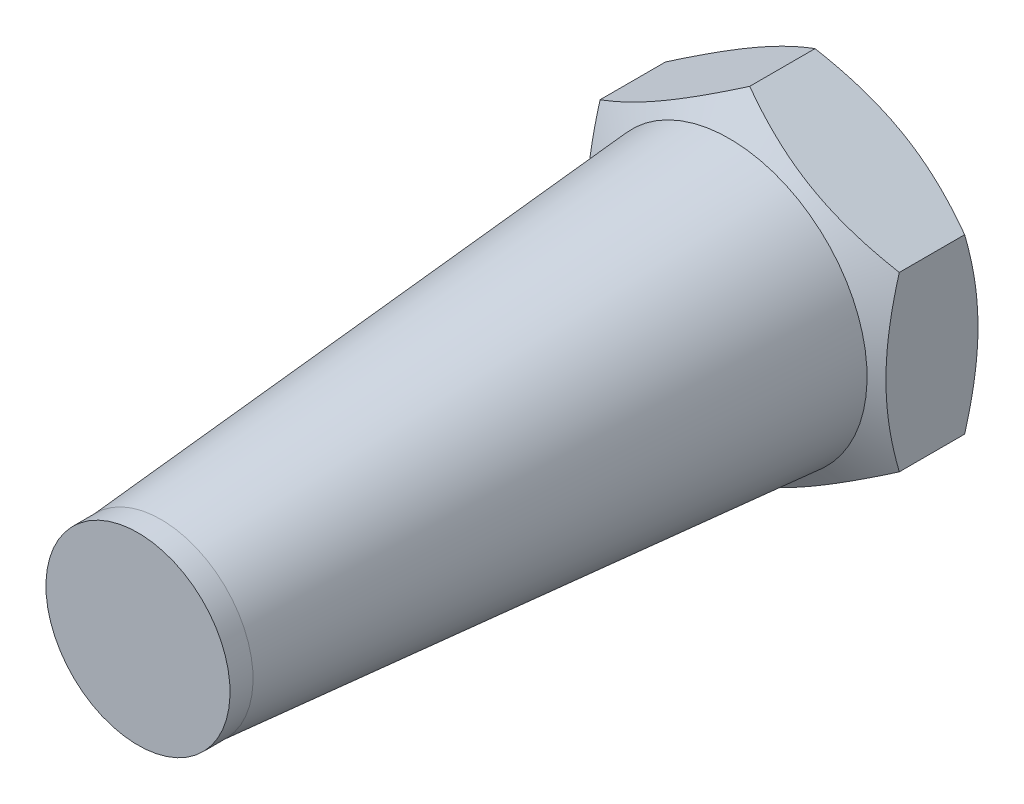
ISO-10303-21;
HEADER;
FILE_DESCRIPTION(('STEP AP214'),'2;1');
FILE_NAME('part.step','',(''),(''),'','','');
FILE_SCHEMA(('AUTOMOTIVE_DESIGN { 1 0 10303 214 1 1 1 1 }'));
ENDSEC;
DATA;
#1=APPLICATION_CONTEXT('core data for automotive mechanical design processes');
#2=APPLICATION_PROTOCOL_DEFINITION('international standard','automotive_design',2000,#1);
#3=PRODUCT_CONTEXT('',#1,'mechanical');
#4=PRODUCT('Part','Part','',(#3));
#5=PRODUCT_RELATED_PRODUCT_CATEGORY('part','',(#4));
#6=PRODUCT_DEFINITION_FORMATION('','',#4);
#7=PRODUCT_DEFINITION_CONTEXT('part definition',#1,'design');
#8=PRODUCT_DEFINITION('design','',#6,#7);
#9=PRODUCT_DEFINITION_SHAPE('','',#8);
#10=(LENGTH_UNIT() NAMED_UNIT(*) SI_UNIT(.MILLI.,.METRE.));
#11=(NAMED_UNIT(*) PLANE_ANGLE_UNIT() SI_UNIT($,.RADIAN.));
#12=(NAMED_UNIT(*) SI_UNIT($,.STERADIAN.) SOLID_ANGLE_UNIT());
#13=UNCERTAINTY_MEASURE_WITH_UNIT(LENGTH_MEASURE(1.E-05),#10,'distance_accuracy_value','');
#14=(GEOMETRIC_REPRESENTATION_CONTEXT(3) GLOBAL_UNCERTAINTY_ASSIGNED_CONTEXT((#13)) GLOBAL_UNIT_ASSIGNED_CONTEXT((#10,
#11,#12)) REPRESENTATION_CONTEXT('',''));
#15=CARTESIAN_POINT('',(0.,0.,0.));
#16=DIRECTION('',(0.,0.,1.));
#17=DIRECTION('',(1.,0.,0.));
#18=AXIS2_PLACEMENT_3D('',#15,#16,#17);
#19=CARTESIAN_POINT('',(0.,0.,2.));
#20=DIRECTION('',(0.,0.,-1.));
#21=DIRECTION('',(0.866025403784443,-0.499999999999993,0.));
#22=AXIS2_PLACEMENT_3D('',#19,#20,#21);
#23=CONICAL_SURFACE('',#22,9.9641016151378,1.0471975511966);
#24=CARTESIAN_POINT('',(0.,0.,4.3002221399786));
#25=DIRECTION('',(0.,0.,-1.));
#26=DIRECTION('',(0.866025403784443,-0.499999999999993,0.));
#27=AXIS2_PLACEMENT_3D('',#24,#25,#26);
#28=CIRCLE('',#27,5.98);
#29=CARTESIAN_POINT('',(5.17883191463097,-2.98999999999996,4.3002221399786));
#30=VERTEX_POINT('',#29);
#31=EDGE_CURVE('E274',#30,#30,#28,.T.);
#32=ORIENTED_EDGE('',*,*,#31,.T.);
#33=EDGE_LOOP('',(#32));
#34=FACE_BOUND('',#33,.T.);
#35=CARTESIAN_POINT('',(-5.50464676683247,10.6836627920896,0.813953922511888));
#36=CARTESIAN_POINT('',(-5.25856626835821,10.5415881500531,0.951906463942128));
#37=CARTESIAN_POINT('',(-5.01192350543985,10.3991888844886,1.08854446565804));
#38=CARTESIAN_POINT('',(-4.517214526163,10.1135685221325,1.35845260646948));
#39=CARTESIAN_POINT('',(-4.26914809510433,9.97034730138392,1.49172222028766));
#40=CARTESIAN_POINT('',(-3.77002670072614,9.68217942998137,1.75481910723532));
#41=CARTESIAN_POINT('',(-3.5189628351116,9.53722763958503,1.88462393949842));
#42=CARTESIAN_POINT('',(-3.01484675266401,9.2461760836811,2.13895929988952));
#43=CARTESIAN_POINT('',(-2.76179462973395,9.10007637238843,2.26349007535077));
#44=CARTESIAN_POINT('',(-2.24505569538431,8.80173700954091,2.50981565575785));
#45=CARTESIAN_POINT('',(-1.98129000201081,8.64945181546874,2.63139101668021));
#46=CARTESIAN_POINT('',(-1.45068168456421,8.34310496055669,2.86540938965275));
#47=CARTESIAN_POINT('',(-1.18383872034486,8.18904310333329,2.97785138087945));
#48=CARTESIAN_POINT('',(-0.647143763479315,7.87918212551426,3.19067263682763));
#49=CARTESIAN_POINT('',(-0.377299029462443,7.72338719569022,3.29107606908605));
#50=CARTESIAN_POINT('',(0.166264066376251,7.40956089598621,3.4766162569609));
#51=CARTESIAN_POINT('',(0.439981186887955,7.25153024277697,3.56175779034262));
#52=CARTESIAN_POINT('',(0.989916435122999,6.93402497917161,3.71225918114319));
#53=CARTESIAN_POINT('',(1.2661121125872,6.77456333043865,3.77772667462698));
#54=CARTESIAN_POINT('',(1.82200305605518,6.45361954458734,3.88518106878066));
#55=CARTESIAN_POINT('',(2.10169797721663,6.29213760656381,3.92717026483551));
#56=CARTESIAN_POINT('',(2.52089047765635,6.05011670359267,3.96975845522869));
#57=CARTESIAN_POINT('',(2.65964585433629,5.970006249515,3.98054959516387));
#58=CARTESIAN_POINT('',(2.9374336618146,5.8096253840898,3.99535095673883));
#59=CARTESIAN_POINT('',(3.07646608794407,5.72935497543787,3.99936129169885));
#60=CARTESIAN_POINT('',(3.35455197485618,5.56880201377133,4.00049782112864));
#61=CARTESIAN_POINT('',(3.4936054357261,5.48851946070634,3.99762398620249));
#62=CARTESIAN_POINT('',(3.77148360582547,5.32808642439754,3.98506477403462));
#63=CARTESIAN_POINT('',(3.91030830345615,5.24793594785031,3.97537906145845));
#64=CARTESIAN_POINT('',(4.24317824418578,5.05575339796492,3.94419318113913));
#65=CARTESIAN_POINT('',(4.43700457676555,4.94384771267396,3.91951007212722));
#66=CARTESIAN_POINT('',(4.8232260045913,4.72086266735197,3.85820420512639));
#67=CARTESIAN_POINT('',(5.01562090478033,4.60978341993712,3.8215798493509));
#68=CARTESIAN_POINT('',(5.59043287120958,4.27791557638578,3.69573612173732));
#69=CARTESIAN_POINT('',(5.97026630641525,4.05861864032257,3.59056847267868));
#70=CARTESIAN_POINT('',(6.53828857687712,3.73067082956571,3.40807580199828));
#71=CARTESIAN_POINT('',(6.72942027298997,3.62032089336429,3.34226066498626));
#72=CARTESIAN_POINT('',(7.10982731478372,3.40069278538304,3.20376518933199));
#73=CARTESIAN_POINT('',(7.29910264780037,3.29141462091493,3.13108480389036));
#74=CARTESIAN_POINT('',(7.67585644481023,3.07389571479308,2.98002751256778));
#75=CARTESIAN_POINT('',(7.86333546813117,2.96565465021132,2.90165244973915));
#76=CARTESIAN_POINT('',(8.23673796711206,2.75007061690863,2.74013098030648));
#77=CARTESIAN_POINT('',(8.42266146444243,2.64272763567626,2.65698464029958));
#78=CARTESIAN_POINT('',(8.87505986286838,2.38153529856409,2.44905554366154));
#79=CARTESIAN_POINT('',(9.14079224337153,2.2281146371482,2.32212222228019));
#80=CARTESIAN_POINT('',(9.6698907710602,1.92263945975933,2.0618223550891));
#81=CARTESIAN_POINT('',(9.93325674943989,1.77058504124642,1.9284553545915));
#82=CARTESIAN_POINT('',(10.4580868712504,1.4675742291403,1.65663156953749));
#83=CARTESIAN_POINT('',(10.7195505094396,1.31661812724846,1.51817348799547));
#84=CARTESIAN_POINT('',(11.2408413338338,1.01565072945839,1.237238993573));
#85=CARTESIAN_POINT('',(11.5006685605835,0.865639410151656,1.09476268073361));
#86=CARTESIAN_POINT('',(12.019282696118,0.566217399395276,0.806400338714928));
#87=CARTESIAN_POINT('',(12.278067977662,0.41680764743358,0.660510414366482));
#88=CARTESIAN_POINT('',(12.7945079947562,0.118640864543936,0.366083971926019));
#89=CARTESIAN_POINT('',(13.0521627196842,-0.0301161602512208,0.217547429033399));
#90=CARTESIAN_POINT('',(13.82363380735,-0.475525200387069,-0.231257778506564));
#91=CARTESIAN_POINT('',(14.3360362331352,-0.771360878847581,-0.534766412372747));
#92=CARTESIAN_POINT('',(15.3127558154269,-1.33527019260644,-1.12056744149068));
#93=CARTESIAN_POINT('',(15.7773029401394,-1.60347660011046,-1.40235093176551));
#94=CARTESIAN_POINT('',(16.7047068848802,-2.13891351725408,-1.9696523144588));
#95=CARTESIAN_POINT('',(17.1675636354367,-2.40614398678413,-2.25517035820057));
#96=CARTESIAN_POINT('',(18.0907213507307,-2.9391293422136,-2.82825869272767));
#97=CARTESIAN_POINT('',(18.5510258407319,-3.20488626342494,-3.11582142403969));
#98=CARTESIAN_POINT('',(19.470562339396,-3.73578090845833,-3.69314970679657));
#99=CARTESIAN_POINT('',(19.9297944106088,-4.00091866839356,-3.98291512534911));
#100=CARTESIAN_POINT('',(20.3886360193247,-4.26583099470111,-4.27349716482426));
#101=B_SPLINE_CURVE_WITH_KNOTS('',3,(#35,#36,#37,#38,#39,#40,#41,#42,#43,#44,#45,#46,#47,#48,
#49,#50,#51,#52,#53,#54,#55,#56,#57,#58,#59,#60,#61,#62,#63,#64,#65,#66,#67,#68,#69,#70,#71,#72,
#73,#74,#75,#76,#77,#78,#79,#80,#81,#82,#83,#84,#85,#86,#87,#88,#89,#90,#91,#92,#93,#94,#95,#96,
#97,#98,#99,#100),.UNSPECIFIED.,.F.,.F.,(4,2,2,2,2,2,2,2,2,2,2,2,2,2,2,2,2,2,2,2,2,2,2,2,2,2,2,
2,2,2,2,2,4),(0.,0.947611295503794,1.89536946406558,2.8482389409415,3.8010636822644,
4.78476621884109,5.76857855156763,6.75038157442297,7.73187670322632,8.70790002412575,
9.68382790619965,10.165457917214,10.6470798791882,11.128703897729,11.6103516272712,
12.285475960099,12.9606906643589,14.3118504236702,15.0027050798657,15.6935644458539,
16.3842012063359,17.074828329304,18.0709060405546,19.0670542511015,20.0634580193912,
21.0598370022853,22.0574144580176,23.0550012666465,25.0498701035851,26.8676185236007,
28.6854408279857,30.4983869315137,32.3112245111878),.UNSPECIFIED.);
#102=CARTESIAN_POINT('',(6.5,3.7527767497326,3.41944341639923));
#103=VERTEX_POINT('',#102);
#104=CARTESIAN_POINT('',(0.,7.50555349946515,3.41944341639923));
#105=VERTEX_POINT('',#104);
#106=EDGE_CURVE('E102',#103,#105,#101,.F.);
#107=ORIENTED_EDGE('',*,*,#106,.T.);
#108=CARTESIAN_POINT('',(0.00019999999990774,7.50566896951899,3.41937674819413));
#109=CARTESIAN_POINT('',(-0.142677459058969,7.42317863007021,3.46699557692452));
#110=CARTESIAN_POINT('',(-0.286087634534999,7.34038072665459,3.5124532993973));
#111=CARTESIAN_POINT('',(-0.574072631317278,7.17411251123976,3.59845131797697));
#112=CARTESIAN_POINT('',(-0.718647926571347,7.09064192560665,3.63898949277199));
#113=CARTESIAN_POINT('',(-1.15468865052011,6.83889369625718,3.7524289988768));
#114=CARTESIAN_POINT('',(-1.4478752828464,6.6696223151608,3.81695219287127));
#115=CARTESIAN_POINT('',(-1.88662374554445,6.41631077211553,3.89261341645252));
#116=CARTESIAN_POINT('',(-2.03087463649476,6.33302748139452,3.91416714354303));
#117=CARTESIAN_POINT('',(-2.32002821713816,6.16608458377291,3.9503096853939));
#118=CARTESIAN_POINT('',(-2.46493084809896,6.0824250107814,3.96489911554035));
#119=CARTESIAN_POINT('',(-2.75498777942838,5.91496056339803,3.98674124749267));
#120=CARTESIAN_POINT('',(-2.90014160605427,5.83115596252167,3.99400227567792));
#121=CARTESIAN_POINT('',(-3.19057533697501,5.66347396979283,4.00103969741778));
#122=CARTESIAN_POINT('',(-3.33585523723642,5.57959658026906,4.0008163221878));
#123=CARTESIAN_POINT('',(-3.73387594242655,5.34979921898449,3.98991654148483));
#124=CARTESIAN_POINT('',(-3.98648646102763,5.20395446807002,3.9716181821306));
#125=CARTESIAN_POINT('',(-4.49002967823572,4.9132336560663,3.91359365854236));
#126=CARTESIAN_POINT('',(-4.74096060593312,4.7683586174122,3.87384766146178));
#127=CARTESIAN_POINT('',(-5.24551722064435,4.47705272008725,3.77449409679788));
#128=CARTESIAN_POINT('',(-5.49907924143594,4.33065861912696,3.71446557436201));
#129=CARTESIAN_POINT('',(-6.00242193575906,4.04005357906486,3.57822500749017));
#130=CARTESIAN_POINT('',(-6.25220905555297,3.89583891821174,3.50204496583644));
#131=CARTESIAN_POINT('',(-6.5002,3.75266127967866,3.41937674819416));
#132=B_SPLINE_CURVE_WITH_KNOTS('',3,(#108,#109,#110,#111,#112,#113,#114,#115,#116,#117,#118,
#119,#120,#121,#122,#123,#124,#125,#126,#127,#128,#129,#130,#131),.UNSPECIFIED.,.F.,.F.,(4,2,2,
2,2,2,2,2,2,2,2,4),(0.,0.51510505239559,1.03043143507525,2.06322554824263,2.56697389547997,
3.07067772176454,3.57380860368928,4.07692394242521,4.9527935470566,5.82947446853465,
6.72559912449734,7.61996451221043),.UNSPECIFIED.);
#133=CARTESIAN_POINT('',(-6.5,3.7527767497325,3.41944341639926));
#134=VERTEX_POINT('',#133);
#135=EDGE_CURVE('E93',#105,#134,#132,.T.);
#136=ORIENTED_EDGE('',*,*,#135,.T.);
#137=CARTESIAN_POINT('',(-6.5,3.75300768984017,3.41937674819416));
#138=CARTESIAN_POINT('',(-6.5,3.58802701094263,3.46699557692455));
#139=CARTESIAN_POINT('',(-6.5,3.42243120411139,3.51245329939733));
#140=CARTESIAN_POINT('',(-6.5,3.08989477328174,3.59845131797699));
#141=CARTESIAN_POINT('',(-6.5,2.92295360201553,3.63898949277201));
#142=CARTESIAN_POINT('',(-6.5,2.41945714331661,3.75242899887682));
#143=CARTESIAN_POINT('',(-6.5,2.08091438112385,3.81695219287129));
#144=CARTESIAN_POINT('',(-6.5,1.57429129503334,3.89261341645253));
#145=CARTESIAN_POINT('',(-6.5,1.40772471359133,3.91416714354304));
#146=CARTESIAN_POINT('',(-6.5,1.07383891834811,3.9503096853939));
#147=CARTESIAN_POINT('',(-6.5,0.9065197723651,3.96489911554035));
#148=CARTESIAN_POINT('',(-6.5,0.571590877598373,3.98674124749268));
#149=CARTESIAN_POINT('',(-6.5,0.403981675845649,3.99400227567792));
#150=CARTESIAN_POINT('',(-6.5,0.0686176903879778,4.00103969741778));
#151=CARTESIAN_POINT('',(-6.5,-0.0991370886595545,4.0008163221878));
#152=CARTESIAN_POINT('',(-6.5,-0.558731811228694,3.98991654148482));
#153=CARTESIAN_POINT('',(-6.5,-0.850421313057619,3.97161818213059));
#154=CARTESIAN_POINT('',(-6.5,-1.43186293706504,3.91359365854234));
#155=CARTESIAN_POINT('',(-6.5,-1.72161301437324,3.87384766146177));
#156=CARTESIAN_POINT('',(-6.5,-2.30422480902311,3.77449409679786));
#157=CARTESIAN_POINT('',(-6.5,-2.59701301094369,3.71446557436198));
#158=CARTESIAN_POINT('',(-6.5,-3.17822309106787,3.57822500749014));
#159=CARTESIAN_POINT('',(-6.5,-3.46665241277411,3.50204496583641));
#160=CARTESIAN_POINT('',(-6.5,-3.75300768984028,3.41937674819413));
#161=B_SPLINE_CURVE_WITH_KNOTS('',3,(#137,#138,#139,#140,#141,#142,#143,#144,#145,#146,#147,
#148,#149,#150,#151,#152,#153,#154,#155,#156,#157,#158,#159,#160),.UNSPECIFIED.,.F.,.F.,(4,2,2,
2,2,2,2,2,2,2,2,4),(0.,0.515105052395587,1.03043143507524,2.06322554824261,2.56697389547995,
3.07067772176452,3.57380860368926,4.07692394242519,4.95279354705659,5.82947446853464,
6.72559912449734,7.61996451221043),.UNSPECIFIED.);
#162=CARTESIAN_POINT('',(-6.5,-3.7527767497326,3.41944341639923));
#163=VERTEX_POINT('',#162);
#164=EDGE_CURVE('E82',#134,#163,#161,.T.);
#165=ORIENTED_EDGE('',*,*,#164,.T.);
#166=CARTESIAN_POINT('',(-12.0046467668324,-0.57466745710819,0.813953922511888));
#167=CARTESIAN_POINT('',(-11.7585662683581,-0.71674209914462,0.951906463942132));
#168=CARTESIAN_POINT('',(-11.5119235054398,-0.859141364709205,1.08854446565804));
#169=CARTESIAN_POINT('',(-11.0172145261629,-1.14476172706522,1.35845260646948));
#170=CARTESIAN_POINT('',(-10.7691480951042,-1.28798294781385,1.49172222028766));
#171=CARTESIAN_POINT('',(-10.270026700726,-1.57615081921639,1.75481910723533));
#172=CARTESIAN_POINT('',(-10.0189628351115,-1.72110260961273,1.88462393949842));
#173=CARTESIAN_POINT('',(-9.51484675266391,-2.01215416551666,2.13895929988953));
#174=CARTESIAN_POINT('',(-9.26179462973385,-2.15825387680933,2.26349007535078));
#175=CARTESIAN_POINT('',(-8.74505569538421,-2.45659323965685,2.50981565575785));
#176=CARTESIAN_POINT('',(-8.48129000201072,-2.60887843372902,2.63139101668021));
#177=CARTESIAN_POINT('',(-7.95068168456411,-2.91522528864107,2.86540938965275));
#178=CARTESIAN_POINT('',(-7.68383872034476,-3.06928714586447,2.97785138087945));
#179=CARTESIAN_POINT('',(-7.14714376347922,-3.3791481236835,3.19067263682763));
#180=CARTESIAN_POINT('',(-6.87729902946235,-3.53494305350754,3.29107606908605));
#181=CARTESIAN_POINT('',(-6.33373593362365,-3.84876935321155,3.4766162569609));
#182=CARTESIAN_POINT('',(-6.06001881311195,-4.00680000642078,3.56175779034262));
#183=CARTESIAN_POINT('',(-5.5100835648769,-4.32430527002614,3.71225918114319));
#184=CARTESIAN_POINT('',(-5.23388788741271,-4.48376691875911,3.77772667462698));
#185=CARTESIAN_POINT('',(-4.67799694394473,-4.80471070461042,3.88518106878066));
#186=CARTESIAN_POINT('',(-4.39830202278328,-4.96619264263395,3.92717026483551));
#187=CARTESIAN_POINT('',(-3.97910952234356,-5.20821354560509,3.96975845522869));
#188=CARTESIAN_POINT('',(-3.84035414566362,-5.28832399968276,3.98054959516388));
#189=CARTESIAN_POINT('',(-3.56256633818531,-5.44870486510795,3.99535095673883));
#190=CARTESIAN_POINT('',(-3.42353391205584,-5.52897527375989,3.99936129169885));
#191=CARTESIAN_POINT('',(-3.14544802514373,-5.68952823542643,4.00049782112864));
#192=CARTESIAN_POINT('',(-3.00639456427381,-5.76981078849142,3.99762398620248));
#193=CARTESIAN_POINT('',(-2.72851639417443,-5.93024382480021,3.98506477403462));
#194=CARTESIAN_POINT('',(-2.58969169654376,-6.01039430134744,3.97537906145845));
#195=CARTESIAN_POINT('',(-2.25682175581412,-6.20257685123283,3.94419318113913));
#196=CARTESIAN_POINT('',(-2.06299542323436,-6.3144825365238,3.91951007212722));
#197=CARTESIAN_POINT('',(-1.67677399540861,-6.53746758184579,3.85820420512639));
#198=CARTESIAN_POINT('',(-1.48437909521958,-6.64854682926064,3.8215798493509));
#199=CARTESIAN_POINT('',(-0.909567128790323,-6.98041467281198,3.69573612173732));
#200=CARTESIAN_POINT('',(-0.529733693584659,-7.19971160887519,3.59056847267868));
#201=CARTESIAN_POINT('',(0.0382885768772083,-7.52765941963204,3.40807580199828));
#202=CARTESIAN_POINT('',(0.229420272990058,-7.63800935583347,3.34226066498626));
#203=CARTESIAN_POINT('',(0.609827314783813,-7.85763746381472,3.20376518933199));
#204=CARTESIAN_POINT('',(0.799102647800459,-7.96691562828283,3.13108480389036));
#205=CARTESIAN_POINT('',(1.17585644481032,-8.18443453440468,2.98002751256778));
#206=CARTESIAN_POINT('',(1.36333546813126,-8.29267559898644,2.90165244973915));
#207=CARTESIAN_POINT('',(1.73673796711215,-8.50825963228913,2.74013098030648));
#208=CARTESIAN_POINT('',(1.92266146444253,-8.61560261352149,2.65698464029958));
#209=CARTESIAN_POINT('',(2.37505986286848,-8.87679495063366,2.44905554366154));
#210=CARTESIAN_POINT('',(2.64079224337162,-9.03021561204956,2.32212222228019));
#211=CARTESIAN_POINT('',(3.16989077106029,-9.33569078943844,2.0618223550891));
#212=CARTESIAN_POINT('',(3.43325674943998,-9.48774520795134,1.9284553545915));
#213=CARTESIAN_POINT('',(3.9580868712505,-9.79075602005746,1.65663156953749));
#214=CARTESIAN_POINT('',(4.21955050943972,-9.9417121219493,1.51817348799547));
#215=CARTESIAN_POINT('',(4.74084133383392,-10.2426795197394,1.237238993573));
#216=CARTESIAN_POINT('',(5.00066856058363,-10.3926908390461,1.09476268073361));
#217=CARTESIAN_POINT('',(5.51928269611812,-10.6921128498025,0.806400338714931));
#218=CARTESIAN_POINT('',(5.77806797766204,-10.8415226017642,0.660510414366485));
#219=CARTESIAN_POINT('',(6.29450799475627,-11.1396893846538,0.366083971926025));
#220=CARTESIAN_POINT('',(6.55216271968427,-11.288446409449,0.217547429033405));
#221=CARTESIAN_POINT('',(7.32363380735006,-11.7338554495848,-0.231257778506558));
#222=CARTESIAN_POINT('',(7.83603623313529,-12.0296911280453,-0.534766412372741));
#223=CARTESIAN_POINT('',(8.81275581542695,-12.5936004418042,-1.12056744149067));
#224=CARTESIAN_POINT('',(9.27730294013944,-12.8618068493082,-1.40235093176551));
#225=CARTESIAN_POINT('',(10.2047068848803,-13.3972437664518,-1.96965231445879));
#226=CARTESIAN_POINT('',(10.6675636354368,-13.6644742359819,-2.25517035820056));
#227=CARTESIAN_POINT('',(11.5907213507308,-14.1974595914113,-2.82825869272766));
#228=CARTESIAN_POINT('',(12.0510258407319,-14.4632165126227,-3.11582142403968));
#229=CARTESIAN_POINT('',(12.970562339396,-14.9941111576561,-3.69314970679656));
#230=CARTESIAN_POINT('',(13.4297944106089,-15.2592489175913,-3.9829151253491));
#231=CARTESIAN_POINT('',(13.8886360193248,-15.5241612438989,-4.27349716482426));
#232=B_SPLINE_CURVE_WITH_KNOTS('',3,(#166,#167,#168,#169,#170,#171,#172,#173,#174,#175,#176,
#177,#178,#179,#180,#181,#182,#183,#184,#185,#186,#187,#188,#189,#190,#191,#192,#193,#194,#195,
#196,#197,#198,#199,#200,#201,#202,#203,#204,#205,#206,#207,#208,#209,#210,#211,#212,#213,#214,
#215,#216,#217,#218,#219,#220,#221,#222,#223,#224,#225,#226,#227,#228,#229,#230,#231),
.UNSPECIFIED.,.F.,.F.,(4,2,2,2,2,2,2,2,2,2,2,2,2,2,2,2,2,2,2,2,2,2,2,2,2,2,2,2,2,2,2,2,4),(0.,
0.947611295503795,1.89536946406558,2.8482389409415,3.80106368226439,4.78476621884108,
5.76857855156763,6.75038157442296,7.73187670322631,8.70790002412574,9.68382790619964,
10.165457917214,10.6470798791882,11.128703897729,11.6103516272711,12.285475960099,
12.9606906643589,14.3118504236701,15.0027050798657,15.6935644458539,16.3842012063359,
17.074828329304,18.0709060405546,19.0670542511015,20.0634580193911,21.0598370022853,
22.0574144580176,23.0550012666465,25.0498701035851,26.8676185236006,28.6854408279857,
30.4983869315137,32.3112245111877),.UNSPECIFIED.);
#233=CARTESIAN_POINT('',(0.,-7.50555349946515,3.41944341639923));
#234=VERTEX_POINT('',#233);
#235=EDGE_CURVE('E228',#163,#234,#232,.T.);
#236=ORIENTED_EDGE('',*,*,#235,.T.);
#237=CARTESIAN_POINT('',(-0.00019999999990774,-7.50566896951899,3.41937674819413));
#238=CARTESIAN_POINT('',(0.142677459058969,-7.42317863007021,3.46699557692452));
#239=CARTESIAN_POINT('',(0.286087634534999,-7.34038072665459,3.5124532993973));
#240=CARTESIAN_POINT('',(0.574072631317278,-7.17411251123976,3.59845131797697));
#241=CARTESIAN_POINT('',(0.718647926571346,-7.09064192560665,3.63898949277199));
#242=CARTESIAN_POINT('',(1.15468865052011,-6.83889369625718,3.7524289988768));
#243=CARTESIAN_POINT('',(1.4478752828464,-6.6696223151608,3.81695219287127));
#244=CARTESIAN_POINT('',(1.88662374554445,-6.41631077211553,3.89261341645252));
#245=CARTESIAN_POINT('',(2.03087463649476,-6.33302748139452,3.91416714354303));
#246=CARTESIAN_POINT('',(2.32002821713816,-6.16608458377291,3.9503096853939));
#247=CARTESIAN_POINT('',(2.46493084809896,-6.0824250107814,3.96489911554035));
#248=CARTESIAN_POINT('',(2.75498777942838,-5.91496056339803,3.98674124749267));
#249=CARTESIAN_POINT('',(2.90014160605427,-5.83115596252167,3.99400227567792));
#250=CARTESIAN_POINT('',(3.19057533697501,-5.66347396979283,4.00103969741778));
#251=CARTESIAN_POINT('',(3.33585523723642,-5.57959658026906,4.0008163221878));
#252=CARTESIAN_POINT('',(3.73387594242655,-5.34979921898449,3.98991654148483));
#253=CARTESIAN_POINT('',(3.98648646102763,-5.20395446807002,3.9716181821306));
#254=CARTESIAN_POINT('',(4.49002967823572,-4.9132336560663,3.91359365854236));
#255=CARTESIAN_POINT('',(4.74096060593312,-4.7683586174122,3.87384766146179));
#256=CARTESIAN_POINT('',(5.24551722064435,-4.47705272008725,3.77449409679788));
#257=CARTESIAN_POINT('',(5.49907924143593,-4.33065861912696,3.71446557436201));
#258=CARTESIAN_POINT('',(6.00242193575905,-4.04005357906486,3.57822500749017));
#259=CARTESIAN_POINT('',(6.25220905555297,-3.89583891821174,3.50204496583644));
#260=CARTESIAN_POINT('',(6.5002,-3.75266127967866,3.41937674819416));
#261=B_SPLINE_CURVE_WITH_KNOTS('',3,(#237,#238,#239,#240,#241,#242,#243,#244,#245,#246,#247,
#248,#249,#250,#251,#252,#253,#254,#255,#256,#257,#258,#259,#260),.UNSPECIFIED.,.F.,.F.,(4,2,2,
2,2,2,2,2,2,2,2,4),(0.,0.515105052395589,1.03043143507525,2.06322554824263,2.56697389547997,
3.07067772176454,3.57380860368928,4.07692394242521,4.9527935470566,5.82947446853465,
6.72559912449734,7.61996451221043),.UNSPECIFIED.);
#262=CARTESIAN_POINT('',(6.5,-3.7527767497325,3.41944341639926));
#263=VERTEX_POINT('',#262);
#264=EDGE_CURVE('E215',#234,#263,#261,.T.);
#265=ORIENTED_EDGE('',*,*,#264,.T.);
#266=CARTESIAN_POINT('',(6.5,-3.75300768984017,3.41937674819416));
#267=CARTESIAN_POINT('',(6.5,-3.58802701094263,3.46699557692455));
#268=CARTESIAN_POINT('',(6.5,-3.42243120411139,3.51245329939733));
#269=CARTESIAN_POINT('',(6.5,-3.08989477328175,3.59845131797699));
#270=CARTESIAN_POINT('',(6.5,-2.92295360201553,3.63898949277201));
#271=CARTESIAN_POINT('',(6.5,-2.41945714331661,3.75242899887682));
#272=CARTESIAN_POINT('',(6.5,-2.08091438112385,3.81695219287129));
#273=CARTESIAN_POINT('',(6.5,-1.57429129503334,3.89261341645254));
#274=CARTESIAN_POINT('',(6.5,-1.40772471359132,3.91416714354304));
#275=CARTESIAN_POINT('',(6.5,-1.0738389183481,3.95030968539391));
#276=CARTESIAN_POINT('',(6.5,-0.906519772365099,3.96489911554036));
#277=CARTESIAN_POINT('',(6.5,-0.571590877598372,3.98674124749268));
#278=CARTESIAN_POINT('',(6.5,-0.403981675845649,3.99400227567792));
#279=CARTESIAN_POINT('',(6.5,-0.0686176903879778,4.00103969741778));
#280=CARTESIAN_POINT('',(6.5,0.0991370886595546,4.0008163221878));
#281=CARTESIAN_POINT('',(6.5,0.558731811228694,3.98991654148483));
#282=CARTESIAN_POINT('',(6.5,0.850421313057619,3.97161818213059));
#283=CARTESIAN_POINT('',(6.5,1.43186293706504,3.91359365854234));
#284=CARTESIAN_POINT('',(6.5,1.72161301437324,3.87384766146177));
#285=CARTESIAN_POINT('',(6.5,2.30422480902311,3.77449409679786));
#286=CARTESIAN_POINT('',(6.5,2.59701301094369,3.71446557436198));
#287=CARTESIAN_POINT('',(6.5,3.17822309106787,3.57822500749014));
#288=CARTESIAN_POINT('',(6.5,3.46665241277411,3.50204496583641));
#289=CARTESIAN_POINT('',(6.5,3.75300768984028,3.41937674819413));
#290=B_SPLINE_CURVE_WITH_KNOTS('',3,(#266,#267,#268,#269,#270,#271,#272,#273,#274,#275,#276,
#277,#278,#279,#280,#281,#282,#283,#284,#285,#286,#287,#288,#289),.UNSPECIFIED.,.F.,.F.,(4,2,2,
2,2,2,2,2,2,2,2,4),(0.,0.515105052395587,1.03043143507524,2.06322554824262,2.56697389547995,
3.07067772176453,3.57380860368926,4.07692394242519,4.95279354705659,5.82947446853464,
6.72559912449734,7.61996451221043),.UNSPECIFIED.);
#291=EDGE_CURVE('E188',#263,#103,#290,.T.);
#292=ORIENTED_EDGE('',*,*,#291,.T.);
#293=EDGE_LOOP('',(#107,#136,#165,#236,#265,#292));
#294=FACE_BOUND('',#293,.T.);
#295=ADVANCED_FACE('F14',(#34,#294),#23,.T.);
#296=CARTESIAN_POINT('',(0.,0.,30.));
#297=DIRECTION('',(0.,0.,1.));
#298=DIRECTION('',(-0.866025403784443,0.499999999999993,0.));
#299=AXIS2_PLACEMENT_3D('',#296,#297,#298);
#300=PLANE('',#299);
#301=CARTESIAN_POINT('',(0.,0.,30.));
#302=DIRECTION('',(0.,0.,-1.));
#303=DIRECTION('',(0.866025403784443,-0.499999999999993,0.));
#304=AXIS2_PLACEMENT_3D('',#301,#302,#303);
#305=CIRCLE('',#304,4.);
#306=CARTESIAN_POINT('',(3.46410161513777,-1.99999999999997,30.));
#307=VERTEX_POINT('',#306);
#308=EDGE_CURVE('E9',#307,#307,#305,.T.);
#309=ORIENTED_EDGE('',*,*,#308,.F.);
#310=EDGE_LOOP('',(#309));
#311=FACE_BOUND('',#310,.T.);
#312=ADVANCED_FACE('F16',(#311),#300,.T.);
#313=CARTESIAN_POINT('',(0.,0.,15.4735));
#314=DIRECTION('',(0.,0.,-1.));
#315=DIRECTION('',(0.866025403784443,-0.499999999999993,0.));
#316=AXIS2_PLACEMENT_3D('',#313,#314,#315);
#317=CYLINDRICAL_SURFACE('',#316,4.);
#318=ORIENTED_EDGE('',*,*,#308,.T.);
#319=EDGE_LOOP('',(#318));
#320=FACE_BOUND('',#319,.T.);
#321=CARTESIAN_POINT('',(0.,0.,29.));
#322=DIRECTION('',(0.,0.,-1.));
#323=DIRECTION('',(0.866025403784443,-0.499999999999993,0.));
#324=AXIS2_PLACEMENT_3D('',#321,#322,#323);
#325=CIRCLE('',#324,4.);
#326=CARTESIAN_POINT('',(3.46410161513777,-1.99999999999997,29.));
#327=VERTEX_POINT('',#326);
#328=EDGE_CURVE('E22',#327,#327,#325,.T.);
#329=ORIENTED_EDGE('',*,*,#328,.F.);
#330=EDGE_LOOP('',(#329));
#331=FACE_BOUND('',#330,.T.);
#332=ADVANCED_FACE('F301',(#320,#331),#317,.T.);
#333=CARTESIAN_POINT('',(0.,0.,4.3002221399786));
#334=DIRECTION('',(0.,0.,-1.));
#335=DIRECTION('',(0.866025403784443,-0.499999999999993,0.));
#336=AXIS2_PLACEMENT_3D('',#333,#334,#335);
#337=CONICAL_SURFACE('',#336,5.98,0.0799916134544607);
#338=ORIENTED_EDGE('',*,*,#328,.T.);
#339=EDGE_LOOP('',(#338));
#340=FACE_BOUND('',#339,.T.);
#341=ORIENTED_EDGE('',*,*,#31,.F.);
#342=EDGE_LOOP('',(#341));
#343=FACE_BOUND('',#342,.T.);
#344=ADVANCED_FACE('F131',(#340,#343),#337,.T.);
#345=CARTESIAN_POINT('',(0.,7.50555349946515,-30.));
#346=DIRECTION('',(-0.500000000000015,0.866025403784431,0.));
#347=DIRECTION('',(-0.866025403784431,-0.500000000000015,0.));
#348=AXIS2_PLACEMENT_3D('',#345,#346,#347);
#349=PLANE('',#348);
#350=DIRECTION('',(0.,0.,1.));
#351=VECTOR('',#350,1.);
#352=CARTESIAN_POINT('',(0.,7.50555349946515,-30.));
#353=LINE('',#352,#351);
#354=CARTESIAN_POINT('',(0.,7.50555349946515,0.580556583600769));
#355=VERTEX_POINT('',#354);
#356=EDGE_CURVE('E258',#355,#105,#353,.T.);
#357=ORIENTED_EDGE('',*,*,#356,.F.);
#358=CARTESIAN_POINT('',(-6.5002,3.75266127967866,0.580623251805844));
#359=CARTESIAN_POINT('',(-6.35732254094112,3.83515161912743,0.533004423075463));
#360=CARTESIAN_POINT('',(-6.21391236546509,3.91794952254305,0.487546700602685));
#361=CARTESIAN_POINT('',(-5.92592736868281,4.08421773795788,0.401548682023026));
#362=CARTESIAN_POINT('',(-5.78135207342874,4.16768832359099,0.361010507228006));
#363=CARTESIAN_POINT('',(-5.34531134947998,4.41943655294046,0.247571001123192));
#364=CARTESIAN_POINT('',(-5.05212471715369,4.58870793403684,0.183047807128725));
#365=CARTESIAN_POINT('',(-4.61337625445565,4.8420194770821,0.107386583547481));
#366=CARTESIAN_POINT('',(-4.46912536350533,4.92530276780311,0.0858328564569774));
#367=CARTESIAN_POINT('',(-4.17997178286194,5.09224566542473,0.0496903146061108));
#368=CARTESIAN_POINT('',(-4.03506915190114,5.17590523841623,0.0351008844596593));
#369=CARTESIAN_POINT('',(-3.74501222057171,5.3433696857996,0.0132587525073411));
#370=CARTESIAN_POINT('',(-3.59985839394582,5.42717428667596,0.00599772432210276));
#371=CARTESIAN_POINT('',(-3.30942466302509,5.59485627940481,-0.00103969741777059));
#372=CARTESIAN_POINT('',(-3.16414476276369,5.67873366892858,-0.000816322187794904));
#373=CARTESIAN_POINT('',(-2.76612405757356,5.90853103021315,0.0100834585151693));
#374=CARTESIAN_POINT('',(-2.51351353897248,6.05437578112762,0.0283818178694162));
#375=CARTESIAN_POINT('',(-2.00997032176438,6.34509659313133,0.0864063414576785));
#376=CARTESIAN_POINT('',(-1.75903939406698,6.48997163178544,0.12615233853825));
#377=CARTESIAN_POINT('',(-1.25448277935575,6.78127752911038,0.225505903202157));
#378=CARTESIAN_POINT('',(-1.00092075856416,6.92767163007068,0.285534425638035));
#379=CARTESIAN_POINT('',(-0.497578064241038,7.21827667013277,0.421774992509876));
#380=CARTESIAN_POINT('',(-0.247790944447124,7.3624913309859,0.4979550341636));
#381=CARTESIAN_POINT('',(0.00019999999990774,7.50566896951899,0.580623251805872));
#382=B_SPLINE_CURVE_WITH_KNOTS('',3,(#358,#359,#360,#361,#362,#363,#364,#365,#366,#367,#368,
#369,#370,#371,#372,#373,#374,#375,#376,#377,#378,#379,#380,#381),.UNSPECIFIED.,.F.,.F.,(4,2,2,
2,2,2,2,2,2,2,2,4),(0.,0.515105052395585,1.03043143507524,2.06322554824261,2.56697389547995,
3.07067772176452,3.57380860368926,4.07692394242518,4.95279354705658,5.82947446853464,
6.72559912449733,7.61996451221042),.UNSPECIFIED.);
#383=CARTESIAN_POINT('',(-3.25000000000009,5.6291651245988,0.));
#384=VERTEX_POINT('',#383);
#385=EDGE_CURVE('E109',#384,#355,#382,.T.);
#386=ORIENTED_EDGE('',*,*,#385,.F.);
#387=CARTESIAN_POINT('',(-6.5,3.7527767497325,0.580556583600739));
#388=VERTEX_POINT('',#387);
#389=EDGE_CURVE('E96',#388,#384,#382,.T.);
#390=ORIENTED_EDGE('',*,*,#389,.F.);
#391=DIRECTION('',(0.,0.,1.));
#392=VECTOR('',#391,1.);
#393=CARTESIAN_POINT('',(-6.5,3.7527767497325,-30.));
#394=LINE('',#393,#392);
#395=EDGE_CURVE('E35',#388,#134,#394,.T.);
#396=ORIENTED_EDGE('',*,*,#395,.T.);
#397=ORIENTED_EDGE('',*,*,#135,.F.);
#398=EDGE_LOOP('',(#357,#386,#390,#396,#397));
#399=FACE_BOUND('',#398,.T.);
#400=ADVANCED_FACE('F92',(#399),#349,.T.);
#401=CARTESIAN_POINT('',(6.5,3.7527767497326,-30.));
#402=DIRECTION('',(0.499999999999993,0.866025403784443,0.));
#403=DIRECTION('',(-0.866025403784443,0.499999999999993,0.));
#404=AXIS2_PLACEMENT_3D('',#401,#402,#403);
#405=PLANE('',#404);
#406=DIRECTION('',(0.,0.,1.));
#407=VECTOR('',#406,1.);
#408=CARTESIAN_POINT('',(6.5,3.7527767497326,-30.));
#409=LINE('',#408,#407);
#410=CARTESIAN_POINT('',(6.5,3.7527767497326,0.580556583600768));
#411=VERTEX_POINT('',#410);
#412=EDGE_CURVE('E255',#411,#103,#409,.T.);
#413=ORIENTED_EDGE('',*,*,#412,.F.);
#414=CARTESIAN_POINT('',(-5.54115218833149,10.7047392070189,3.20652898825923));
#415=CARTESIAN_POINT('',(-5.29477516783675,10.5624933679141,3.06824212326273));
#416=CARTESIAN_POINT('',(-5.04783912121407,10.4199247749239,2.93126086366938));
#417=CARTESIAN_POINT('',(-4.55255194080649,10.1339705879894,2.66064242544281));
#418=CARTESIAN_POINT('',(-4.30420059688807,9.99058487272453,2.5270057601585));
#419=CARTESIAN_POINT('',(-3.80453528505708,9.70210297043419,2.26315208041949));
#420=CARTESIAN_POINT('',(-3.55321258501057,9.55700174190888,2.13295703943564));
#421=CARTESIAN_POINT('',(-3.04858964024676,9.26565754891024,1.8778010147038));
#422=CARTESIAN_POINT('',(-2.79528948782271,9.11941463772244,1.75283978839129));
#423=CARTESIAN_POINT('',(-2.27788742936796,8.82069241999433,1.50550497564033));
#424=CARTESIAN_POINT('',(-2.01370538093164,8.66816684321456,1.38335372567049));
#425=CARTESIAN_POINT('',(-1.48227292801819,8.36134417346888,1.14812603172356));
#426=CARTESIAN_POINT('',(-1.21502218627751,8.20704688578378,1.03505059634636));
#427=CARTESIAN_POINT('',(-0.677508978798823,7.89671349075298,0.820891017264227));
#428=CARTESIAN_POINT('',(-0.407253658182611,7.74068150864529,0.71978319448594));
#429=CARTESIAN_POINT('',(0.137136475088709,7.42637771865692,0.532757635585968));
#430=CARTESIAN_POINT('',(0.41127005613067,7.26810662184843,0.446835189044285));
#431=CARTESIAN_POINT('',(0.962017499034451,6.95013243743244,0.294716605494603));
#432=CARTESIAN_POINT('',(1.23860819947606,6.79044272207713,0.228410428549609));
#433=CARTESIAN_POINT('',(1.79533222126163,6.46901795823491,0.119232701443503));
#434=CARTESIAN_POINT('',(2.075465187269,6.30728311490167,0.0763588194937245));
#435=CARTESIAN_POINT('',(2.49534082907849,6.0648678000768,0.0324660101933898));
#436=CARTESIAN_POINT('',(2.63431772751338,5.98462945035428,0.0212465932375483));
#437=CARTESIAN_POINT('',(2.91256414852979,5.82398380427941,0.00560203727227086));
#438=CARTESIAN_POINT('',(3.05183366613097,5.74357651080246,0.0011767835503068));
#439=CARTESIAN_POINT('',(3.33040824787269,5.58274140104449,-0.000766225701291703));
#440=CARTESIAN_POINT('',(3.46971331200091,5.50231358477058,0.00171601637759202));
#441=CARTESIAN_POINT('',(3.74810781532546,5.34158244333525,0.0135243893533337));
#442=CARTESIAN_POINT('',(3.8871972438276,5.26127912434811,0.0228508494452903));
#443=CARTESIAN_POINT('',(4.21963736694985,5.06934472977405,0.0531229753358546));
#444=CARTESIAN_POINT('',(4.41277894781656,4.95783438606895,0.0771985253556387));
#445=CARTESIAN_POINT('',(4.79765951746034,4.73562348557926,0.137250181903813));
#446=CARTESIAN_POINT('',(4.98939831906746,4.62492303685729,0.17322784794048));
#447=CARTESIAN_POINT('',(5.56227463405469,4.29417274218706,0.297109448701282));
#448=CARTESIAN_POINT('',(5.94086491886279,4.07559353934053,0.40094059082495));
#449=CARTESIAN_POINT('',(6.50702481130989,3.74872097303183,0.581447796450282));
#450=CARTESIAN_POINT('',(6.6975208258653,3.63873804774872,0.646593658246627));
#451=CARTESIAN_POINT('',(7.07666370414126,3.41983980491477,0.783766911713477));
#452=CARTESIAN_POINT('',(7.26531055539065,3.31092449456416,0.855794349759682));
#453=CARTESIAN_POINT('',(7.64081231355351,3.09412845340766,1.00556559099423));
#454=CARTESIAN_POINT('',(7.82766776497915,2.98624740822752,1.08330759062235));
#455=CARTESIAN_POINT('',(8.19982403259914,2.77138288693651,1.24358180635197));
#456=CARTESIAN_POINT('',(8.38512486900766,2.66439939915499,1.32611396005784));
#457=CARTESIAN_POINT('',(8.82994392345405,2.4075829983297,1.52979204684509));
#458=CARTESIAN_POINT('',(9.08878329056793,2.25814202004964,1.65291133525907));
#459=CARTESIAN_POINT('',(9.60418751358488,1.96057325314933,1.90536084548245));
#460=CARTESIAN_POINT('',(9.86075221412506,1.81244555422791,2.03469148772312));
#461=CARTESIAN_POINT('',(10.3720363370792,1.51725552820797,2.29828873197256));
#462=CARTESIAN_POINT('',(10.6267553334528,1.37019344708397,2.43255643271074));
#463=CARTESIAN_POINT('',(11.1346169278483,1.07697941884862,2.70501702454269));
#464=CARTESIAN_POINT('',(11.387759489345,0.930827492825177,2.8432100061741));
#465=CARTESIAN_POINT('',(11.8930170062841,0.639116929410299,3.12292631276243));
#466=CARTESIAN_POINT('',(12.1451304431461,0.493559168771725,3.26445328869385));
#467=CARTESIAN_POINT('',(12.6482508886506,0.203082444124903,3.55010805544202));
#468=CARTESIAN_POINT('',(12.8992578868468,0.0581634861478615,3.69423587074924));
#469=CARTESIAN_POINT('',(13.6508155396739,-0.375748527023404,4.1297725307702));
#470=CARTESIAN_POINT('',(14.1499773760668,-0.663939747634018,4.42437620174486));
#471=CARTESIAN_POINT('',(15.1023905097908,-1.21381572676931,4.99368726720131));
#472=CARTESIAN_POINT('',(15.5558642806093,-1.4756289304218,5.26790069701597));
#473=CARTESIAN_POINT('',(16.4611277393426,-1.99828303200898,5.82005580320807));
#474=CARTESIAN_POINT('',(16.9129173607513,-2.25912389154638,6.09799762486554));
#475=CARTESIAN_POINT('',(17.813986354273,-2.77935631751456,6.65596618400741));
#476=CARTESIAN_POINT('',(18.2632692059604,-3.03874989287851,6.93598544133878));
#477=CARTESIAN_POINT('',(19.1607624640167,-3.55691786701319,7.49823452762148));
#478=CARTESIAN_POINT('',(19.6089729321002,-3.81569230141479,7.78046422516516));
#479=CARTESIAN_POINT('',(20.0567911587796,-4.0742402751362,8.06351575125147));
#480=B_SPLINE_CURVE_WITH_KNOTS('',3,(#414,#415,#416,#417,#418,#419,#420,#421,#422,#423,#424,
#425,#426,#427,#428,#429,#430,#431,#432,#433,#434,#435,#436,#437,#438,#439,#440,#441,#442,#443,
#444,#445,#446,#447,#448,#449,#450,#451,#452,#453,#454,#455,#456,#457,#458,#459,#460,#461,#462,
#463,#464,#465,#466,#467,#468,#469,#470,#471,#472,#473,#474,#475,#476,#477,#478,#479),
.UNSPECIFIED.,.F.,.F.,(4,2,2,2,2,2,2,2,2,2,2,2,2,2,2,2,2,2,2,2,2,2,2,2,2,2,2,2,2,2,2,2,4),(0.,
0.948973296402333,1.89809136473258,2.85225848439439,3.80638133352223,4.79206603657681,
5.77786012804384,6.76166991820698,7.74517399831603,8.72305155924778,9.70083179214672,
10.1833150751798,10.6657902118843,11.1482651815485,11.630763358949,12.3033341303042,
12.9759930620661,14.3220280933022,15.0101990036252,15.6983745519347,16.3863338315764,
17.0742841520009,18.0439299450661,19.0136414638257,19.9835701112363,20.9535211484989,
21.9245888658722,22.8956657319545,24.8375327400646,26.6107620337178,28.3840606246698,
30.1526583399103,31.9211517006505),.UNSPECIFIED.);
#481=CARTESIAN_POINT('',(3.24999999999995,5.62916512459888,0.));
#482=VERTEX_POINT('',#481);
#483=EDGE_CURVE('E180',#482,#411,#480,.T.);
#484=ORIENTED_EDGE('',*,*,#483,.F.);
#485=EDGE_CURVE('E187',#355,#482,#480,.T.);
#486=ORIENTED_EDGE('',*,*,#485,.F.);
#487=ORIENTED_EDGE('',*,*,#356,.T.);
#488=ORIENTED_EDGE('',*,*,#106,.F.);
#489=EDGE_LOOP('',(#413,#484,#486,#487,#488));
#490=FACE_BOUND('',#489,.T.);
#491=ADVANCED_FACE('F130',(#490),#405,.T.);
#492=CARTESIAN_POINT('',(6.5,-3.7527767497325,-30.));
#493=DIRECTION('',(1.,0.,0.));
#494=DIRECTION('',(0.,1.,0.));
#495=AXIS2_PLACEMENT_3D('',#492,#493,#494);
#496=PLANE('',#495);
#497=DIRECTION('',(0.,0.,1.));
#498=VECTOR('',#497,1.);
#499=CARTESIAN_POINT('',(6.5,-3.7527767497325,-30.));
#500=LINE('',#499,#498);
#501=CARTESIAN_POINT('',(6.5,-3.7527767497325,0.580556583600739));
#502=VERTEX_POINT('',#501);
#503=EDGE_CURVE('E250',#502,#263,#500,.T.);
#504=ORIENTED_EDGE('',*,*,#503,.F.);
#505=CARTESIAN_POINT('',(6.5,3.75300768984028,0.580623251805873));
#506=CARTESIAN_POINT('',(6.5,3.58802701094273,0.533004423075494));
#507=CARTESIAN_POINT('',(6.5,3.42243120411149,0.487546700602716));
#508=CARTESIAN_POINT('',(6.5,3.08989477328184,0.401548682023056));
#509=CARTESIAN_POINT('',(6.5,2.92295360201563,0.361010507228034));
#510=CARTESIAN_POINT('',(6.5,2.41945714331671,0.247571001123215));
#511=CARTESIAN_POINT('',(6.5,2.08091438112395,0.183047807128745));
#512=CARTESIAN_POINT('',(6.5,1.57429129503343,0.107386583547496));
#513=CARTESIAN_POINT('',(6.5,1.40772471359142,0.0858328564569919));
#514=CARTESIAN_POINT('',(6.5,1.0738389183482,0.0496903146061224));
#515=CARTESIAN_POINT('',(6.5,0.90651977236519,0.0351008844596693));
#516=CARTESIAN_POINT('',(6.5,0.571590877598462,0.0132587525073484));
#517=CARTESIAN_POINT('',(6.5,0.403981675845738,0.00599772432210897));
#518=CARTESIAN_POINT('',(6.5,0.0686176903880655,-0.00103969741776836));
#519=CARTESIAN_POINT('',(6.5,-0.0991370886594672,-0.000816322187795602));
#520=CARTESIAN_POINT('',(6.5,-0.558731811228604,0.0100834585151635));
#521=CARTESIAN_POINT('',(6.5,-0.850421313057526,0.0283818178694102));
#522=CARTESIAN_POINT('',(6.5,-1.43186293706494,0.0864063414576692));
#523=CARTESIAN_POINT('',(6.5,-1.72161301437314,0.126152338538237));
#524=CARTESIAN_POINT('',(6.5,-2.30422480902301,0.225505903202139));
#525=CARTESIAN_POINT('',(6.5,-2.59701301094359,0.285534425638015));
#526=CARTESIAN_POINT('',(6.5,-3.17822309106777,0.421774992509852));
#527=CARTESIAN_POINT('',(6.5,-3.46665241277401,0.497955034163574));
#528=CARTESIAN_POINT('',(6.5,-3.75300768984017,0.580623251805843));
#529=B_SPLINE_CURVE_WITH_KNOTS('',3,(#505,#506,#507,#508,#509,#510,#511,#512,#513,#514,#515,
#516,#517,#518,#519,#520,#521,#522,#523,#524,#525,#526,#527,#528),.UNSPECIFIED.,.F.,.F.,(4,2,2,
2,2,2,2,2,2,2,2,4),(0.,0.515105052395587,1.03043143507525,2.06322554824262,2.56697389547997,
3.07067772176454,3.57380860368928,4.0769239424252,4.9527935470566,5.82947446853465,
6.72559912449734,7.61996451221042),.UNSPECIFIED.);
#530=CARTESIAN_POINT('',(6.5,0.,0.));
#531=VERTEX_POINT('',#530);
#532=EDGE_CURVE('E172',#531,#502,#529,.T.);
#533=ORIENTED_EDGE('',*,*,#532,.F.);
#534=EDGE_CURVE('E223',#411,#531,#529,.T.);
#535=ORIENTED_EDGE('',*,*,#534,.F.);
#536=ORIENTED_EDGE('',*,*,#412,.T.);
#537=ORIENTED_EDGE('',*,*,#291,.F.);
#538=EDGE_LOOP('',(#504,#533,#535,#536,#537));
#539=FACE_BOUND('',#538,.T.);
#540=ADVANCED_FACE('F200',(#539),#496,.T.);
#541=CARTESIAN_POINT('',(0.,-7.50555349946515,-30.));
#542=DIRECTION('',(0.500000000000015,-0.866025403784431,0.));
#543=DIRECTION('',(0.866025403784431,0.500000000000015,0.));
#544=AXIS2_PLACEMENT_3D('',#541,#542,#543);
#545=PLANE('',#544);
#546=DIRECTION('',(0.,0.,1.));
#547=VECTOR('',#546,1.);
#548=CARTESIAN_POINT('',(0.,-7.50555349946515,-30.));
#549=LINE('',#548,#547);
#550=CARTESIAN_POINT('',(0.,-7.50555349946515,0.580556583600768));
#551=VERTEX_POINT('',#550);
#552=EDGE_CURVE('E248',#551,#234,#549,.T.);
#553=ORIENTED_EDGE('',*,*,#552,.F.);
#554=CARTESIAN_POINT('',(6.5002,-3.75266127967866,0.580623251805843));
#555=CARTESIAN_POINT('',(6.35732254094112,-3.83515161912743,0.533004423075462));
#556=CARTESIAN_POINT('',(6.21391236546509,-3.91794952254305,0.487546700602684));
#557=CARTESIAN_POINT('',(5.92592736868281,-4.08421773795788,0.401548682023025));
#558=CARTESIAN_POINT('',(5.78135207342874,-4.16768832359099,0.361010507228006));
#559=CARTESIAN_POINT('',(5.34531134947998,-4.41943655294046,0.247571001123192));
#560=CARTESIAN_POINT('',(5.0521247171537,-4.58870793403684,0.183047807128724));
#561=CARTESIAN_POINT('',(4.61337625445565,-4.8420194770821,0.10738658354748));
#562=CARTESIAN_POINT('',(4.46912536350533,-4.92530276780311,0.0858328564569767));
#563=CARTESIAN_POINT('',(4.17997178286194,-5.09224566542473,0.0496903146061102));
#564=CARTESIAN_POINT('',(4.03506915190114,-5.17590523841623,0.0351008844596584));
#565=CARTESIAN_POINT('',(3.74501222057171,-5.3433696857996,0.0132587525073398));
#566=CARTESIAN_POINT('',(3.59985839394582,-5.42717428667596,0.00599772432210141));
#567=CARTESIAN_POINT('',(3.30942466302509,-5.59485627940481,-0.00103969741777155));
#568=CARTESIAN_POINT('',(3.16414476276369,-5.67873366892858,-0.000816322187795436));
#569=CARTESIAN_POINT('',(2.76612405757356,-5.90853103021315,0.0100834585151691));
#570=CARTESIAN_POINT('',(2.51351353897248,-6.05437578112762,0.0283818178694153));
#571=CARTESIAN_POINT('',(2.00997032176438,-6.34509659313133,0.0864063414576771));
#572=CARTESIAN_POINT('',(1.75903939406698,-6.48997163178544,0.126152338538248));
#573=CARTESIAN_POINT('',(1.25448277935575,-6.78127752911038,0.225505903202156));
#574=CARTESIAN_POINT('',(1.00092075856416,-6.92767163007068,0.285534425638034));
#575=CARTESIAN_POINT('',(0.497578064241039,-7.21827667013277,0.421774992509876));
#576=CARTESIAN_POINT('',(0.247790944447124,-7.3624913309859,0.497955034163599));
#577=CARTESIAN_POINT('',(-0.00019999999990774,-7.50566896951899,0.580623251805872));
#578=B_SPLINE_CURVE_WITH_KNOTS('',3,(#554,#555,#556,#557,#558,#559,#560,#561,#562,#563,#564,
#565,#566,#567,#568,#569,#570,#571,#572,#573,#574,#575,#576,#577),.UNSPECIFIED.,.F.,.F.,(4,2,2,
2,2,2,2,2,2,2,2,4),(0.,0.515105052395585,1.03043143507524,2.06322554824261,2.56697389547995,
3.07067772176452,3.57380860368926,4.07692394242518,4.95279354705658,5.82947446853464,
6.72559912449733,7.61996451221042),.UNSPECIFIED.);
#579=CARTESIAN_POINT('',(3.2500000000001,-5.6291651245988,0.));
#580=VERTEX_POINT('',#579);
#581=EDGE_CURVE('E164',#580,#551,#578,.T.);
#582=ORIENTED_EDGE('',*,*,#581,.F.);
#583=EDGE_CURVE('E221',#502,#580,#578,.T.);
#584=ORIENTED_EDGE('',*,*,#583,.F.);
#585=ORIENTED_EDGE('',*,*,#503,.T.);
#586=ORIENTED_EDGE('',*,*,#264,.F.);
#587=EDGE_LOOP('',(#553,#582,#584,#585,#586));
#588=FACE_BOUND('',#587,.T.);
#589=ADVANCED_FACE('F206',(#588),#545,.T.);
#590=CARTESIAN_POINT('',(-6.5,-3.7527767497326,-30.));
#591=DIRECTION('',(-0.499999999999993,-0.866025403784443,0.));
#592=DIRECTION('',(0.866025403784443,-0.499999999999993,0.));
#593=AXIS2_PLACEMENT_3D('',#590,#591,#592);
#594=PLANE('',#593);
#595=DIRECTION('',(0.,0.,1.));
#596=VECTOR('',#595,1.);
#597=CARTESIAN_POINT('',(-6.5,-3.7527767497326,-30.));
#598=LINE('',#597,#596);
#599=CARTESIAN_POINT('',(-6.5,-3.7527767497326,0.580556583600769));
#600=VERTEX_POINT('',#599);
#601=EDGE_CURVE('E29',#600,#163,#598,.T.);
#602=ORIENTED_EDGE('',*,*,#601,.F.);
#603=CARTESIAN_POINT('',(-12.0411521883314,-0.553591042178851,3.20652898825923));
#604=CARTESIAN_POINT('',(-11.7947751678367,-0.695836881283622,3.06824212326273));
#605=CARTESIAN_POINT('',(-11.547839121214,-0.838405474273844,2.93126086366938));
#606=CARTESIAN_POINT('',(-11.0525519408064,-1.12435966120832,2.66064242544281));
#607=CARTESIAN_POINT('',(-10.804200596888,-1.26774537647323,2.5270057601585));
#608=CARTESIAN_POINT('',(-10.304535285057,-1.55622727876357,2.26315208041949));
#609=CARTESIAN_POINT('',(-10.0532125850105,-1.70132850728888,2.13295703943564));
#610=CARTESIAN_POINT('',(-9.54858964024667,-1.99267270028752,1.8778010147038));
#611=CARTESIAN_POINT('',(-9.29528948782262,-2.13891561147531,1.75283978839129));
#612=CARTESIAN_POINT('',(-8.77788742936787,-2.43763782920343,1.50550497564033));
#613=CARTESIAN_POINT('',(-8.51370538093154,-2.5901634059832,1.38335372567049));
#614=CARTESIAN_POINT('',(-7.9822729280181,-2.89698607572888,1.14812603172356));
#615=CARTESIAN_POINT('',(-7.71502218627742,-3.05128336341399,1.03505059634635));
#616=CARTESIAN_POINT('',(-7.17750897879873,-3.36161675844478,0.820891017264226));
#617=CARTESIAN_POINT('',(-6.90725365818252,-3.51764874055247,0.719783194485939));
#618=CARTESIAN_POINT('',(-6.3628635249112,-3.83195253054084,0.532757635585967));
#619=CARTESIAN_POINT('',(-6.08872994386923,-3.99022362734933,0.446835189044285));
#620=CARTESIAN_POINT('',(-5.53798250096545,-4.30819781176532,0.294716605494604));
#621=CARTESIAN_POINT('',(-5.26139180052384,-4.46788752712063,0.228410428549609));
#622=CARTESIAN_POINT('',(-4.70466777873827,-4.78931229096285,0.119232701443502));
#623=CARTESIAN_POINT('',(-4.42453481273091,-4.95104713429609,0.0763588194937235));
#624=CARTESIAN_POINT('',(-4.00465917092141,-5.19346244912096,0.0324660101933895));
#625=CARTESIAN_POINT('',(-3.86568227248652,-5.27370079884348,0.0212465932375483));
#626=CARTESIAN_POINT('',(-3.58743585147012,-5.43434644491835,0.00560203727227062));
#627=CARTESIAN_POINT('',(-3.44816633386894,-5.5147537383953,0.00117678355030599));
#628=CARTESIAN_POINT('',(-3.16959175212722,-5.67558884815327,-0.000766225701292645));
#629=CARTESIAN_POINT('',(-3.030286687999,-5.75601666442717,0.00171601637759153));
#630=CARTESIAN_POINT('',(-2.75189218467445,-5.91674780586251,0.0135243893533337));
#631=CARTESIAN_POINT('',(-2.61280275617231,-5.99705112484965,0.0228508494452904));
#632=CARTESIAN_POINT('',(-2.28036263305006,-6.18898551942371,0.0531229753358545));
#633=CARTESIAN_POINT('',(-2.08722105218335,-6.30049586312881,0.0771985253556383));
#634=CARTESIAN_POINT('',(-1.70234048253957,-6.5227067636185,0.137250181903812));
#635=CARTESIAN_POINT('',(-1.51060168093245,-6.63340721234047,0.17322784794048));
#636=CARTESIAN_POINT('',(-0.937725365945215,-6.9641575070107,0.297109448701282));
#637=CARTESIAN_POINT('',(-0.559135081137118,-7.18273670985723,0.400940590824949));
#638=CARTESIAN_POINT('',(0.0070248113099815,-7.50960927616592,0.581447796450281));
#639=CARTESIAN_POINT('',(0.197520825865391,-7.61959220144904,0.646593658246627));
#640=CARTESIAN_POINT('',(0.576663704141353,-7.83849044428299,0.783766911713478));
#641=CARTESIAN_POINT('',(0.765310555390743,-7.9474057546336,0.855794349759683));
#642=CARTESIAN_POINT('',(1.14081231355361,-8.1642017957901,1.00556559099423));
#643=CARTESIAN_POINT('',(1.32766776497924,-8.27208284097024,1.08330759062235));
#644=CARTESIAN_POINT('',(1.69982403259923,-8.48694736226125,1.24358180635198));
#645=CARTESIAN_POINT('',(1.88512486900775,-8.59393085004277,1.32611396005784));
#646=CARTESIAN_POINT('',(2.32994392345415,-8.85074725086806,1.52979204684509));
#647=CARTESIAN_POINT('',(2.58878329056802,-9.00018822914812,1.65291133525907));
#648=CARTESIAN_POINT('',(3.10418751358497,-9.29775699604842,1.90536084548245));
#649=CARTESIAN_POINT('',(3.36075221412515,-9.44588469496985,2.03469148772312));
#650=CARTESIAN_POINT('',(3.87203633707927,-9.74107472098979,2.29828873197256));
#651=CARTESIAN_POINT('',(4.12675533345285,-9.88813680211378,2.43255643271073));
#652=CARTESIAN_POINT('',(4.63461692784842,-10.1813508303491,2.70501702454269));
#653=CARTESIAN_POINT('',(4.88775948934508,-10.3275027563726,2.84321000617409));
#654=CARTESIAN_POINT('',(5.3930170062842,-10.6192133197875,3.12292631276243));
#655=CARTESIAN_POINT('',(5.64513044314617,-10.764771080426,3.26445328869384));
#656=CARTESIAN_POINT('',(6.14825088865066,-11.0552478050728,3.55010805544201));
#657=CARTESIAN_POINT('',(6.39925788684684,-11.2001667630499,3.69423587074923));
#658=CARTESIAN_POINT('',(7.15081553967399,-11.6340787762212,4.1297725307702));
#659=CARTESIAN_POINT('',(7.64997737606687,-11.9222699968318,4.42437620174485));
#660=CARTESIAN_POINT('',(8.6023905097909,-12.4721459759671,4.99368726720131));
#661=CARTESIAN_POINT('',(9.05586428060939,-12.7339591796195,5.26790069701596));
#662=CARTESIAN_POINT('',(9.96112773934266,-13.2566132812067,5.82005580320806));
#663=CARTESIAN_POINT('',(10.4129173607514,-13.5174541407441,6.09799762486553));
#664=CARTESIAN_POINT('',(11.3139863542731,-14.0376865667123,6.6559661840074));
#665=CARTESIAN_POINT('',(11.7632692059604,-14.2970801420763,6.93598544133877));
#666=CARTESIAN_POINT('',(12.6607624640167,-14.8152481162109,7.49823452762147));
#667=CARTESIAN_POINT('',(13.1089729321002,-15.0740225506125,7.78046422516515));
#668=CARTESIAN_POINT('',(13.5567911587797,-15.3325705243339,8.06351575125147));
#669=B_SPLINE_CURVE_WITH_KNOTS('',3,(#603,#604,#605,#606,#607,#608,#609,#610,#611,#612,#613,
#614,#615,#616,#617,#618,#619,#620,#621,#622,#623,#624,#625,#626,#627,#628,#629,#630,#631,#632,
#633,#634,#635,#636,#637,#638,#639,#640,#641,#642,#643,#644,#645,#646,#647,#648,#649,#650,#651,
#652,#653,#654,#655,#656,#657,#658,#659,#660,#661,#662,#663,#664,#665,#666,#667,#668),
.UNSPECIFIED.,.F.,.F.,(4,2,2,2,2,2,2,2,2,2,2,2,2,2,2,2,2,2,2,2,2,2,2,2,2,2,2,2,2,2,2,2,4),(0.,
0.948973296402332,1.89809136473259,2.85225848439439,3.80638133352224,4.79206603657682,
5.77786012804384,6.76166991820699,7.74517399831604,8.72305155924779,9.70083179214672,
10.1833150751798,10.6657902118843,11.1482651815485,11.630763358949,12.3033341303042,
12.9759930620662,14.3220280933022,15.0101990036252,15.6983745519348,16.3863338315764,
17.0742841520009,18.0439299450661,19.0136414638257,19.9835701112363,20.9535211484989,
21.9245888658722,22.8956657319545,24.8375327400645,26.6107620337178,28.3840606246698,
30.1526583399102,31.9211517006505),.UNSPECIFIED.);
#670=CARTESIAN_POINT('',(-3.24999999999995,-5.62916512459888,0.));
#671=VERTEX_POINT('',#670);
#672=EDGE_CURVE('E87',#671,#600,#669,.F.);
#673=ORIENTED_EDGE('',*,*,#672,.F.);
#674=EDGE_CURVE('E232',#551,#671,#669,.F.);
#675=ORIENTED_EDGE('',*,*,#674,.F.);
#676=ORIENTED_EDGE('',*,*,#552,.T.);
#677=ORIENTED_EDGE('',*,*,#235,.F.);
#678=EDGE_LOOP('',(#602,#673,#675,#676,#677));
#679=FACE_BOUND('',#678,.T.);
#680=ADVANCED_FACE('F211',(#679),#594,.T.);
#681=CARTESIAN_POINT('',(-6.5,3.7527767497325,-30.));
#682=DIRECTION('',(-1.,0.,0.));
#683=DIRECTION('',(0.,-1.,0.));
#684=AXIS2_PLACEMENT_3D('',#681,#682,#683);
#685=PLANE('',#684);
#686=ORIENTED_EDGE('',*,*,#395,.F.);
#687=CARTESIAN_POINT('',(-6.5,-3.75300768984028,0.580623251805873));
#688=CARTESIAN_POINT('',(-6.5,-3.58802701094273,0.533004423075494));
#689=CARTESIAN_POINT('',(-6.5,-3.42243120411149,0.487546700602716));
#690=CARTESIAN_POINT('',(-6.5,-3.08989477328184,0.401548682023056));
#691=CARTESIAN_POINT('',(-6.5,-2.92295360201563,0.361010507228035));
#692=CARTESIAN_POINT('',(-6.5,-2.41945714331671,0.247571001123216));
#693=CARTESIAN_POINT('',(-6.5,-2.08091438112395,0.183047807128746));
#694=CARTESIAN_POINT('',(-6.5,-1.57429129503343,0.107386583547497));
#695=CARTESIAN_POINT('',(-6.5,-1.40772471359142,0.0858328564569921));
#696=CARTESIAN_POINT('',(-6.5,-1.0738389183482,0.0496903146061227));
#697=CARTESIAN_POINT('',(-6.5,-0.90651977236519,0.03510088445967));
#698=CARTESIAN_POINT('',(-6.5,-0.571590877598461,0.013258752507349));
#699=CARTESIAN_POINT('',(-6.5,-0.403981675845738,0.0059977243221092));
#700=CARTESIAN_POINT('',(-6.5,-0.0686176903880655,-0.00103969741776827));
#701=CARTESIAN_POINT('',(-6.5,0.0991370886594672,-0.00081632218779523));
#702=CARTESIAN_POINT('',(-6.5,0.558731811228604,0.0100834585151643));
#703=CARTESIAN_POINT('',(-6.5,0.850421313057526,0.0283818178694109));
#704=CARTESIAN_POINT('',(-6.5,1.43186293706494,0.0864063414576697));
#705=CARTESIAN_POINT('',(-6.5,1.72161301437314,0.126152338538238));
#706=CARTESIAN_POINT('',(-6.5,2.30422480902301,0.22550590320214));
#707=CARTESIAN_POINT('',(-6.5,2.59701301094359,0.285534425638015));
#708=CARTESIAN_POINT('',(-6.5,3.17822309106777,0.421774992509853));
#709=CARTESIAN_POINT('',(-6.5,3.46665241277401,0.497955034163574));
#710=CARTESIAN_POINT('',(-6.5,3.75300768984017,0.580623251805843));
#711=B_SPLINE_CURVE_WITH_KNOTS('',3,(#687,#688,#689,#690,#691,#692,#693,#694,#695,#696,#697,
#698,#699,#700,#701,#702,#703,#704,#705,#706,#707,#708,#709,#710),.UNSPECIFIED.,.F.,.F.,(4,2,2,
2,2,2,2,2,2,2,2,4),(0.,0.515105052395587,1.03043143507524,2.06322554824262,2.56697389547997,
3.07067772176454,3.57380860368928,4.0769239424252,4.9527935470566,5.82947446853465,
6.72559912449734,7.61996451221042),.UNSPECIFIED.);
#712=CARTESIAN_POINT('',(-6.5,0.,0.));
#713=VERTEX_POINT('',#712);
#714=EDGE_CURVE('E149',#713,#388,#711,.T.);
#715=ORIENTED_EDGE('',*,*,#714,.F.);
#716=EDGE_CURVE('E88',#600,#713,#711,.T.);
#717=ORIENTED_EDGE('',*,*,#716,.F.);
#718=ORIENTED_EDGE('',*,*,#601,.T.);
#719=ORIENTED_EDGE('',*,*,#164,.F.);
#720=EDGE_LOOP('',(#686,#715,#717,#718,#719));
#721=FACE_BOUND('',#720,.T.);
#722=ADVANCED_FACE('F83',(#721),#685,.T.);
#723=CARTESIAN_POINT('',(0.,0.,0.));
#724=DIRECTION('',(0.,0.,1.));
#725=DIRECTION('',(-0.866025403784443,0.499999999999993,0.));
#726=AXIS2_PLACEMENT_3D('',#723,#724,#725);
#727=CONICAL_SURFACE('',#726,6.5,1.0471975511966);
#728=CARTESIAN_POINT('',(0.,0.,0.));
#729=DIRECTION('',(0.,0.,-1.));
#730=DIRECTION('',(0.866025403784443,-0.499999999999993,0.));
#731=AXIS2_PLACEMENT_3D('',#728,#729,#730);
#732=CIRCLE('',#731,6.5);
#733=EDGE_CURVE('E103',#531,#580,#732,.T.);
#734=ORIENTED_EDGE('',*,*,#733,.F.);
#735=ORIENTED_EDGE('',*,*,#532,.T.);
#736=ORIENTED_EDGE('',*,*,#583,.T.);
#737=EDGE_LOOP('',(#734,#735,#736));
#738=FACE_BOUND('',#737,.T.);
#739=ADVANCED_FACE('F285',(#738),#727,.T.);
#740=EDGE_CURVE('E106',#482,#531,#732,.T.);
#741=ORIENTED_EDGE('',*,*,#740,.F.);
#742=ORIENTED_EDGE('',*,*,#483,.T.);
#743=ORIENTED_EDGE('',*,*,#534,.T.);
#744=EDGE_LOOP('',(#741,#742,#743));
#745=FACE_BOUND('',#744,.T.);
#746=ADVANCED_FACE('F283',(#745),#727,.T.);
#747=EDGE_CURVE('E277',#384,#482,#732,.T.);
#748=ORIENTED_EDGE('',*,*,#747,.F.);
#749=ORIENTED_EDGE('',*,*,#385,.T.);
#750=ORIENTED_EDGE('',*,*,#485,.T.);
#751=EDGE_LOOP('',(#748,#749,#750));
#752=FACE_BOUND('',#751,.T.);
#753=ADVANCED_FACE('F144',(#752),#727,.T.);
#754=EDGE_CURVE('E243',#671,#713,#732,.T.);
#755=ORIENTED_EDGE('',*,*,#754,.F.);
#756=ORIENTED_EDGE('',*,*,#672,.T.);
#757=ORIENTED_EDGE('',*,*,#716,.T.);
#758=EDGE_LOOP('',(#755,#756,#757));
#759=FACE_BOUND('',#758,.T.);
#760=ADVANCED_FACE('F145',(#759),#727,.T.);
#761=EDGE_CURVE('E108',#580,#671,#732,.T.);
#762=ORIENTED_EDGE('',*,*,#761,.F.);
#763=ORIENTED_EDGE('',*,*,#581,.T.);
#764=ORIENTED_EDGE('',*,*,#674,.T.);
#765=EDGE_LOOP('',(#762,#763,#764));
#766=FACE_BOUND('',#765,.T.);
#767=ADVANCED_FACE('F138',(#766),#727,.T.);
#768=CARTESIAN_POINT('',(5.62916512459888,-3.24999999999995,0.));
#769=DIRECTION('',(0.,0.,-1.));
#770=DIRECTION('',(0.866025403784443,-0.499999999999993,0.));
#771=AXIS2_PLACEMENT_3D('',#768,#769,#770);
#772=PLANE('',#771);
#773=CARTESIAN_POINT('',(0.,0.,0.));
#774=DIRECTION('',(0.,0.,-1.));
#775=DIRECTION('',(-0.866025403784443,0.499999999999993,0.));
#776=AXIS2_PLACEMENT_3D('',#773,#774,#775);
#777=CIRCLE('',#776,4.);
#778=CARTESIAN_POINT('',(-3.46410161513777,1.99999999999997,0.));
#779=VERTEX_POINT('',#778);
#780=EDGE_CURVE('E260',#779,#779,#777,.T.);
#781=ORIENTED_EDGE('',*,*,#780,.F.);
#782=EDGE_LOOP('',(#781));
#783=FACE_BOUND('',#782,.T.);
#784=ORIENTED_EDGE('',*,*,#761,.T.);
#785=ORIENTED_EDGE('',*,*,#754,.T.);
#786=EDGE_CURVE('E276',#713,#384,#732,.T.);
#787=ORIENTED_EDGE('',*,*,#786,.T.);
#788=ORIENTED_EDGE('',*,*,#747,.T.);
#789=ORIENTED_EDGE('',*,*,#740,.T.);
#790=ORIENTED_EDGE('',*,*,#733,.T.);
#791=EDGE_LOOP('',(#784,#785,#787,#788,#789,#790));
#792=FACE_BOUND('',#791,.T.);
#793=ADVANCED_FACE('F134',(#783,#792),#772,.T.);
#794=ORIENTED_EDGE('',*,*,#714,.T.);
#795=ORIENTED_EDGE('',*,*,#389,.T.);
#796=ORIENTED_EDGE('',*,*,#786,.F.);
#797=EDGE_LOOP('',(#794,#795,#796));
#798=FACE_BOUND('',#797,.T.);
#799=ADVANCED_FACE('F137',(#798),#727,.T.);
#800=CARTESIAN_POINT('',(0.,0.,9.));
#801=DIRECTION('',(0.,0.,-1.));
#802=DIRECTION('',(-0.866025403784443,0.499999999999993,0.));
#803=AXIS2_PLACEMENT_3D('',#800,#801,#802);
#804=CYLINDRICAL_SURFACE('',#803,4.);
#805=CARTESIAN_POINT('',(0.,0.,9.));
#806=DIRECTION('',(0.,0.,-1.));
#807=DIRECTION('',(-0.866025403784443,0.499999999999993,0.));
#808=AXIS2_PLACEMENT_3D('',#805,#806,#807);
#809=CIRCLE('',#808,4.);
#810=CARTESIAN_POINT('',(-3.46410161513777,1.99999999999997,9.));
#811=VERTEX_POINT('',#810);
#812=EDGE_CURVE('E98',#811,#811,#809,.T.);
#813=ORIENTED_EDGE('',*,*,#812,.F.);
#814=EDGE_LOOP('',(#813));
#815=FACE_BOUND('',#814,.T.);
#816=ORIENTED_EDGE('',*,*,#780,.T.);
#817=EDGE_LOOP('',(#816));
#818=FACE_BOUND('',#817,.T.);
#819=ADVANCED_FACE('F142',(#815,#818),#804,.F.);
#820=CARTESIAN_POINT('',(0.,0.,9.));
#821=DIRECTION('',(0.,0.,-1.));
#822=DIRECTION('',(-0.866025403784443,0.499999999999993,0.));
#823=AXIS2_PLACEMENT_3D('',#820,#821,#822);
#824=PLANE('',#823);
#825=ORIENTED_EDGE('',*,*,#812,.T.);
#826=EDGE_LOOP('',(#825));
#827=FACE_BOUND('',#826,.T.);
#828=ADVANCED_FACE('F266',(#827),#824,.T.);
#829=CLOSED_SHELL('',(#295,#312,#332,#344,#400,#491,#540,#589,#680,#722,#739,#746,#753,#760,
#767,#793,#799,#819,#828));
#830=MANIFOLD_SOLID_BREP('B1',#829);
#831=ADVANCED_BREP_SHAPE_REPRESENTATION('',(#18,#830),#14);
#832=SHAPE_DEFINITION_REPRESENTATION(#9,#831);
ENDSEC;
END-ISO-10303-21;
